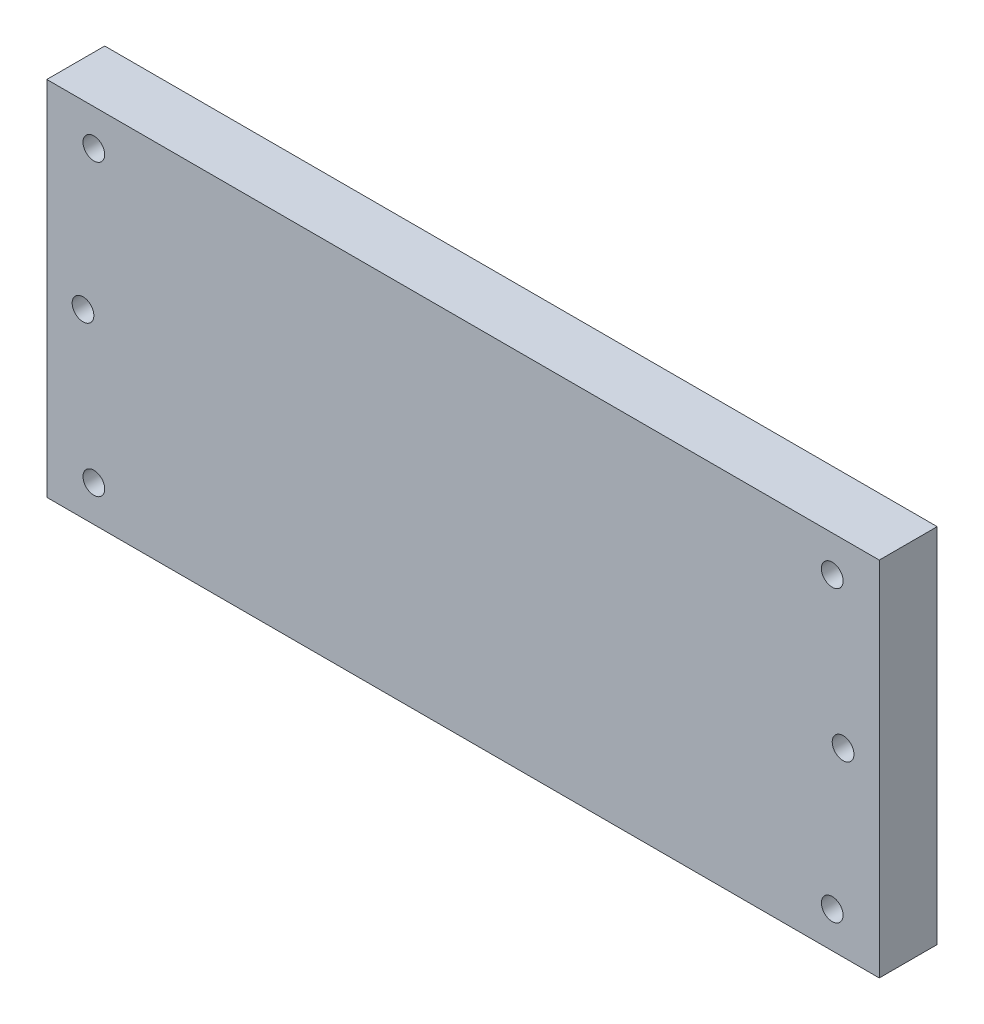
ISO-10303-21;
HEADER;
FILE_DESCRIPTION(('STEP AP214'),'2;1');
FILE_NAME('part.step','',(''),(''),'','','');
FILE_SCHEMA(('AUTOMOTIVE_DESIGN { 1 0 10303 214 1 1 1 1 }'));
ENDSEC;
DATA;
#1=APPLICATION_CONTEXT('core data for automotive mechanical design processes');
#2=APPLICATION_PROTOCOL_DEFINITION('international standard','automotive_design',2000,#1);
#3=PRODUCT_CONTEXT('',#1,'mechanical');
#4=PRODUCT('Part','Part','',(#3));
#5=PRODUCT_RELATED_PRODUCT_CATEGORY('part','',(#4));
#6=PRODUCT_DEFINITION_FORMATION('','',#4);
#7=PRODUCT_DEFINITION_CONTEXT('part definition',#1,'design');
#8=PRODUCT_DEFINITION('design','',#6,#7);
#9=PRODUCT_DEFINITION_SHAPE('','',#8);
#10=(LENGTH_UNIT() NAMED_UNIT(*) SI_UNIT(.MILLI.,.METRE.));
#11=(NAMED_UNIT(*) PLANE_ANGLE_UNIT() SI_UNIT($,.RADIAN.));
#12=(NAMED_UNIT(*) SI_UNIT($,.STERADIAN.) SOLID_ANGLE_UNIT());
#13=UNCERTAINTY_MEASURE_WITH_UNIT(LENGTH_MEASURE(1.E-05),#10,'distance_accuracy_value','');
#14=(GEOMETRIC_REPRESENTATION_CONTEXT(3) GLOBAL_UNCERTAINTY_ASSIGNED_CONTEXT((#13)) GLOBAL_UNIT_ASSIGNED_CONTEXT((#10,
#11,#12)) REPRESENTATION_CONTEXT('',''));
#15=CARTESIAN_POINT('',(0.,0.,0.));
#16=DIRECTION('',(0.,0.,1.));
#17=DIRECTION('',(1.,0.,0.));
#18=AXIS2_PLACEMENT_3D('',#15,#16,#17);
#19=CARTESIAN_POINT('',(-33.7316222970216,28.093300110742,8.));
#20=DIRECTION('',(1.,0.,0.));
#21=DIRECTION('',(0.,1.,0.));
#22=AXIS2_PLACEMENT_3D('',#19,#20,#21);
#23=PLANE('',#22);
#24=DIRECTION('',(0.,-1.,0.));
#25=VECTOR('',#24,1.);
#26=CARTESIAN_POINT('',(-33.7316222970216,28.093300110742,0.));
#27=LINE('',#26,#25);
#28=CARTESIAN_POINT('',(-33.7316222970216,28.093300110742,0.));
#29=VERTEX_POINT('',#28);
#30=CARTESIAN_POINT('',(-33.7316222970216,-21.906699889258,0.));
#31=VERTEX_POINT('',#30);
#32=EDGE_CURVE('E99',#29,#31,#27,.T.);
#33=ORIENTED_EDGE('',*,*,#32,.T.);
#34=DIRECTION('',(0.,0.,-1.));
#35=VECTOR('',#34,1.);
#36=CARTESIAN_POINT('',(-33.7316222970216,-21.906699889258,8.));
#37=LINE('',#36,#35);
#38=CARTESIAN_POINT('',(-33.7316222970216,-21.906699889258,8.));
#39=VERTEX_POINT('',#38);
#40=EDGE_CURVE('E11',#39,#31,#37,.T.);
#41=ORIENTED_EDGE('',*,*,#40,.F.);
#42=DIRECTION('',(0.,-1.,0.));
#43=VECTOR('',#42,1.);
#44=CARTESIAN_POINT('',(-33.7316222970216,28.093300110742,8.));
#45=LINE('',#44,#43);
#46=CARTESIAN_POINT('',(-33.7316222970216,28.093300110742,8.));
#47=VERTEX_POINT('',#46);
#48=EDGE_CURVE('E86',#47,#39,#45,.T.);
#49=ORIENTED_EDGE('',*,*,#48,.F.);
#50=DIRECTION('',(0.,0.,-1.));
#51=VECTOR('',#50,1.);
#52=CARTESIAN_POINT('',(-33.7316222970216,28.093300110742,8.));
#53=LINE('',#52,#51);
#54=EDGE_CURVE('E95',#47,#29,#53,.T.);
#55=ORIENTED_EDGE('',*,*,#54,.T.);
#56=EDGE_LOOP('',(#33,#41,#49,#55));
#57=FACE_BOUND('',#56,.T.);
#58=ADVANCED_FACE('F33',(#57),#23,.F.);
#59=CARTESIAN_POINT('',(-33.7316222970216,-21.906699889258,8.));
#60=DIRECTION('',(0.,1.,0.));
#61=DIRECTION('',(0.,0.,1.));
#62=AXIS2_PLACEMENT_3D('',#59,#60,#61);
#63=PLANE('',#62);
#64=DIRECTION('',(1.,0.,0.));
#65=VECTOR('',#64,1.);
#66=CARTESIAN_POINT('',(-33.7316222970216,-21.906699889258,0.));
#67=LINE('',#66,#65);
#68=CARTESIAN_POINT('',(81.2683777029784,-21.906699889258,0.));
#69=VERTEX_POINT('',#68);
#70=EDGE_CURVE('E90',#31,#69,#67,.T.);
#71=ORIENTED_EDGE('',*,*,#70,.T.);
#72=DIRECTION('',(0.,0.,-1.));
#73=VECTOR('',#72,1.);
#74=CARTESIAN_POINT('',(81.2683777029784,-21.906699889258,8.));
#75=LINE('',#74,#73);
#76=CARTESIAN_POINT('',(81.2683777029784,-21.906699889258,8.));
#77=VERTEX_POINT('',#76);
#78=EDGE_CURVE('E42',#77,#69,#75,.T.);
#79=ORIENTED_EDGE('',*,*,#78,.F.);
#80=DIRECTION('',(1.,0.,0.));
#81=VECTOR('',#80,1.);
#82=CARTESIAN_POINT('',(-33.7316222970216,-21.906699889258,8.));
#83=LINE('',#82,#81);
#84=EDGE_CURVE('E81',#39,#77,#83,.T.);
#85=ORIENTED_EDGE('',*,*,#84,.F.);
#86=ORIENTED_EDGE('',*,*,#40,.T.);
#87=EDGE_LOOP('',(#71,#79,#85,#86));
#88=FACE_BOUND('',#87,.T.);
#89=ADVANCED_FACE('F89',(#88),#63,.F.);
#90=CARTESIAN_POINT('',(81.2683777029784,28.093300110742,8.));
#91=DIRECTION('',(-1.,0.,0.));
#92=DIRECTION('',(0.,-1.,0.));
#93=AXIS2_PLACEMENT_3D('',#90,#91,#92);
#94=PLANE('',#93);
#95=DIRECTION('',(0.,1.,0.));
#96=VECTOR('',#95,1.);
#97=CARTESIAN_POINT('',(81.2683777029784,28.093300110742,0.));
#98=LINE('',#97,#96);
#99=CARTESIAN_POINT('',(81.2683777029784,28.093300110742,0.));
#100=VERTEX_POINT('',#99);
#101=EDGE_CURVE('E68',#69,#100,#98,.T.);
#102=ORIENTED_EDGE('',*,*,#101,.T.);
#103=DIRECTION('',(0.,0.,-1.));
#104=VECTOR('',#103,1.);
#105=CARTESIAN_POINT('',(81.2683777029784,28.093300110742,8.));
#106=LINE('',#105,#104);
#107=CARTESIAN_POINT('',(81.2683777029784,28.093300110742,8.));
#108=VERTEX_POINT('',#107);
#109=EDGE_CURVE('E91',#108,#100,#106,.T.);
#110=ORIENTED_EDGE('',*,*,#109,.F.);
#111=DIRECTION('',(0.,1.,0.));
#112=VECTOR('',#111,1.);
#113=CARTESIAN_POINT('',(81.2683777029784,28.093300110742,8.));
#114=LINE('',#113,#112);
#115=EDGE_CURVE('E84',#77,#108,#114,.T.);
#116=ORIENTED_EDGE('',*,*,#115,.F.);
#117=ORIENTED_EDGE('',*,*,#78,.T.);
#118=EDGE_LOOP('',(#102,#110,#116,#117));
#119=FACE_BOUND('',#118,.T.);
#120=ADVANCED_FACE('F93',(#119),#94,.F.);
#121=CARTESIAN_POINT('',(-33.7316222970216,28.093300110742,8.));
#122=DIRECTION('',(0.,-1.,0.));
#123=DIRECTION('',(0.,0.,-1.));
#124=AXIS2_PLACEMENT_3D('',#121,#122,#123);
#125=PLANE('',#124);
#126=DIRECTION('',(-1.,0.,0.));
#127=VECTOR('',#126,1.);
#128=CARTESIAN_POINT('',(-33.7316222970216,28.093300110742,0.));
#129=LINE('',#128,#127);
#130=EDGE_CURVE('E74',#100,#29,#129,.T.);
#131=ORIENTED_EDGE('',*,*,#130,.T.);
#132=ORIENTED_EDGE('',*,*,#54,.F.);
#133=DIRECTION('',(-1.,0.,0.));
#134=VECTOR('',#133,1.);
#135=CARTESIAN_POINT('',(-33.7316222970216,28.093300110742,8.));
#136=LINE('',#135,#134);
#137=EDGE_CURVE('E51',#108,#47,#136,.T.);
#138=ORIENTED_EDGE('',*,*,#137,.F.);
#139=ORIENTED_EDGE('',*,*,#109,.T.);
#140=EDGE_LOOP('',(#131,#132,#138,#139));
#141=FACE_BOUND('',#140,.T.);
#142=ADVANCED_FACE('F165',(#141),#125,.F.);
#143=CARTESIAN_POINT('',(0.,0.,8.));
#144=DIRECTION('',(0.,0.,1.));
#145=DIRECTION('',(1.,0.,0.));
#146=AXIS2_PLACEMENT_3D('',#143,#144,#145);
#147=PLANE('',#146);
#148=CARTESIAN_POINT('',(76.2683777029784,3.09330010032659,8.));
#149=DIRECTION('',(0.,0.,1.));
#150=DIRECTION('',(1.,0.,0.));
#151=AXIS2_PLACEMENT_3D('',#148,#149,#150);
#152=CIRCLE('',#151,1.5);
#153=CARTESIAN_POINT('',(77.7683777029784,3.09330010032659,8.));
#154=VERTEX_POINT('',#153);
#155=EDGE_CURVE('E136',#154,#154,#152,.T.);
#156=ORIENTED_EDGE('',*,*,#155,.F.);
#157=EDGE_LOOP('',(#156));
#158=FACE_BOUND('',#157,.T.);
#159=CARTESIAN_POINT('',(-28.7316222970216,3.09330010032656,8.));
#160=DIRECTION('',(0.,0.,1.));
#161=DIRECTION('',(1.,0.,0.));
#162=AXIS2_PLACEMENT_3D('',#159,#160,#161);
#163=CIRCLE('',#162,1.5);
#164=CARTESIAN_POINT('',(-27.2316222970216,3.09330010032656,8.));
#165=VERTEX_POINT('',#164);
#166=EDGE_CURVE('E126',#165,#165,#163,.T.);
#167=ORIENTED_EDGE('',*,*,#166,.F.);
#168=EDGE_LOOP('',(#167));
#169=FACE_BOUND('',#168,.T.);
#170=CARTESIAN_POINT('',(74.7683777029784,-16.906699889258,8.));
#171=DIRECTION('',(0.,0.,1.));
#172=DIRECTION('',(1.,0.,0.));
#173=AXIS2_PLACEMENT_3D('',#170,#171,#172);
#174=CIRCLE('',#173,1.5);
#175=CARTESIAN_POINT('',(76.2683777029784,-16.906699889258,8.));
#176=VERTEX_POINT('',#175);
#177=EDGE_CURVE('E123',#176,#176,#174,.T.);
#178=ORIENTED_EDGE('',*,*,#177,.F.);
#179=EDGE_LOOP('',(#178));
#180=FACE_BOUND('',#179,.T.);
#181=CARTESIAN_POINT('',(74.7683777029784,23.093300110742,8.));
#182=DIRECTION('',(0.,0.,1.));
#183=DIRECTION('',(1.,0.,0.));
#184=AXIS2_PLACEMENT_3D('',#181,#182,#183);
#185=CIRCLE('',#184,1.5);
#186=CARTESIAN_POINT('',(76.2683777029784,23.093300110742,8.));
#187=VERTEX_POINT('',#186);
#188=EDGE_CURVE('E120',#187,#187,#185,.T.);
#189=ORIENTED_EDGE('',*,*,#188,.F.);
#190=EDGE_LOOP('',(#189));
#191=FACE_BOUND('',#190,.T.);
#192=CARTESIAN_POINT('',(-27.2316222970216,-16.906699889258,8.));
#193=DIRECTION('',(0.,0.,1.));
#194=DIRECTION('',(1.,0.,0.));
#195=AXIS2_PLACEMENT_3D('',#192,#193,#194);
#196=CIRCLE('',#195,1.5);
#197=CARTESIAN_POINT('',(-25.7316222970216,-16.906699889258,8.));
#198=VERTEX_POINT('',#197);
#199=EDGE_CURVE('E116',#198,#198,#196,.T.);
#200=ORIENTED_EDGE('',*,*,#199,.F.);
#201=EDGE_LOOP('',(#200));
#202=FACE_BOUND('',#201,.T.);
#203=CARTESIAN_POINT('',(-27.2316222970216,23.0933001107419,8.));
#204=DIRECTION('',(0.,0.,1.));
#205=DIRECTION('',(1.,0.,0.));
#206=AXIS2_PLACEMENT_3D('',#203,#204,#205);
#207=CIRCLE('',#206,1.5);
#208=CARTESIAN_POINT('',(-25.7316222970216,23.0933001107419,8.));
#209=VERTEX_POINT('',#208);
#210=EDGE_CURVE('E112',#209,#209,#207,.T.);
#211=ORIENTED_EDGE('',*,*,#210,.F.);
#212=EDGE_LOOP('',(#211));
#213=FACE_BOUND('',#212,.T.);
#214=ORIENTED_EDGE('',*,*,#48,.T.);
#215=ORIENTED_EDGE('',*,*,#84,.T.);
#216=ORIENTED_EDGE('',*,*,#115,.T.);
#217=ORIENTED_EDGE('',*,*,#137,.T.);
#218=EDGE_LOOP('',(#214,#215,#216,#217));
#219=FACE_BOUND('',#218,.T.);
#220=ADVANCED_FACE('F82',(#158,#169,#180,#191,#202,#213,#219),#147,.T.);
#221=CARTESIAN_POINT('',(0.,0.,0.));
#222=DIRECTION('',(0.,0.,1.));
#223=DIRECTION('',(1.,0.,0.));
#224=AXIS2_PLACEMENT_3D('',#221,#222,#223);
#225=PLANE('',#224);
#226=CARTESIAN_POINT('',(74.7683777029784,-16.906699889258,0.));
#227=DIRECTION('',(0.,0.,1.));
#228=DIRECTION('',(1.,0.,0.));
#229=AXIS2_PLACEMENT_3D('',#226,#227,#228);
#230=CIRCLE('',#229,1.5);
#231=CARTESIAN_POINT('',(76.2683777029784,-16.906699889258,0.));
#232=VERTEX_POINT('',#231);
#233=EDGE_CURVE('E121',#232,#232,#230,.T.);
#234=ORIENTED_EDGE('',*,*,#233,.T.);
#235=EDGE_LOOP('',(#234));
#236=FACE_BOUND('',#235,.T.);
#237=CARTESIAN_POINT('',(74.7683777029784,23.093300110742,0.));
#238=DIRECTION('',(0.,0.,1.));
#239=DIRECTION('',(1.,0.,0.));
#240=AXIS2_PLACEMENT_3D('',#237,#238,#239);
#241=CIRCLE('',#240,1.5);
#242=CARTESIAN_POINT('',(76.2683777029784,23.093300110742,0.));
#243=VERTEX_POINT('',#242);
#244=EDGE_CURVE('E117',#243,#243,#241,.T.);
#245=ORIENTED_EDGE('',*,*,#244,.T.);
#246=EDGE_LOOP('',(#245));
#247=FACE_BOUND('',#246,.T.);
#248=CARTESIAN_POINT('',(-27.2316222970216,-16.906699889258,0.));
#249=DIRECTION('',(0.,0.,1.));
#250=DIRECTION('',(1.,0.,0.));
#251=AXIS2_PLACEMENT_3D('',#248,#249,#250);
#252=CIRCLE('',#251,1.5);
#253=CARTESIAN_POINT('',(-25.7316222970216,-16.906699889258,0.));
#254=VERTEX_POINT('',#253);
#255=EDGE_CURVE('E113',#254,#254,#252,.T.);
#256=ORIENTED_EDGE('',*,*,#255,.T.);
#257=EDGE_LOOP('',(#256));
#258=FACE_BOUND('',#257,.T.);
#259=CARTESIAN_POINT('',(-27.2316222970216,23.0933001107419,0.));
#260=DIRECTION('',(0.,0.,1.));
#261=DIRECTION('',(1.,0.,0.));
#262=AXIS2_PLACEMENT_3D('',#259,#260,#261);
#263=CIRCLE('',#262,1.5);
#264=CARTESIAN_POINT('',(-25.7316222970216,23.0933001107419,0.));
#265=VERTEX_POINT('',#264);
#266=EDGE_CURVE('E108',#265,#265,#263,.T.);
#267=ORIENTED_EDGE('',*,*,#266,.T.);
#268=EDGE_LOOP('',(#267));
#269=FACE_BOUND('',#268,.T.);
#270=CARTESIAN_POINT('',(-28.7316222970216,3.09330010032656,0.));
#271=DIRECTION('',(0.,0.,-1.));
#272=DIRECTION('',(-1.,0.,0.));
#273=AXIS2_PLACEMENT_3D('',#270,#271,#272);
#274=CIRCLE('',#273,4.00000000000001);
#275=CARTESIAN_POINT('',(-32.7316222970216,3.09330010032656,0.));
#276=VERTEX_POINT('',#275);
#277=EDGE_CURVE('E111',#276,#276,#274,.T.);
#278=ORIENTED_EDGE('',*,*,#277,.F.);
#279=EDGE_LOOP('',(#278));
#280=FACE_BOUND('',#279,.T.);
#281=CARTESIAN_POINT('',(76.2683777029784,3.09330010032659,0.));
#282=DIRECTION('',(0.,0.,-1.));
#283=DIRECTION('',(-1.,0.,0.));
#284=AXIS2_PLACEMENT_3D('',#281,#282,#283);
#285=CIRCLE('',#284,4.00000000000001);
#286=CARTESIAN_POINT('',(72.2683777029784,3.09330010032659,0.));
#287=VERTEX_POINT('',#286);
#288=EDGE_CURVE('E148',#287,#287,#285,.T.);
#289=ORIENTED_EDGE('',*,*,#288,.F.);
#290=EDGE_LOOP('',(#289));
#291=FACE_BOUND('',#290,.T.);
#292=ORIENTED_EDGE('',*,*,#32,.F.);
#293=ORIENTED_EDGE('',*,*,#130,.F.);
#294=ORIENTED_EDGE('',*,*,#101,.F.);
#295=ORIENTED_EDGE('',*,*,#70,.F.);
#296=EDGE_LOOP('',(#292,#293,#294,#295));
#297=FACE_BOUND('',#296,.T.);
#298=ADVANCED_FACE('F158',(#236,#247,#258,#269,#280,#291,#297),#225,.F.);
#299=CARTESIAN_POINT('',(76.2683777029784,3.09330010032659,4.));
#300=DIRECTION('',(0.,0.,-1.));
#301=DIRECTION('',(-1.,0.,0.));
#302=AXIS2_PLACEMENT_3D('',#299,#300,#301);
#303=CYLINDRICAL_SURFACE('',#302,4.00000000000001);
#304=CARTESIAN_POINT('',(76.2683777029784,3.09330010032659,4.));
#305=DIRECTION('',(0.,0.,-1.));
#306=DIRECTION('',(-1.,0.,0.));
#307=AXIS2_PLACEMENT_3D('',#304,#305,#306);
#308=CIRCLE('',#307,4.00000000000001);
#309=CARTESIAN_POINT('',(72.2683777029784,3.09330010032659,4.));
#310=VERTEX_POINT('',#309);
#311=EDGE_CURVE('E102',#310,#310,#308,.T.);
#312=ORIENTED_EDGE('',*,*,#311,.F.);
#313=EDGE_LOOP('',(#312));
#314=FACE_BOUND('',#313,.T.);
#315=ORIENTED_EDGE('',*,*,#288,.T.);
#316=EDGE_LOOP('',(#315));
#317=FACE_BOUND('',#316,.T.);
#318=ADVANCED_FACE('F156',(#314,#317),#303,.F.);
#319=CARTESIAN_POINT('',(76.2683777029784,3.09330010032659,4.));
#320=DIRECTION('',(0.,0.,-1.));
#321=DIRECTION('',(-1.,0.,0.));
#322=AXIS2_PLACEMENT_3D('',#319,#320,#321);
#323=PLANE('',#322);
#324=CARTESIAN_POINT('',(76.2683777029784,3.09330010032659,4.));
#325=DIRECTION('',(0.,0.,-1.));
#326=DIRECTION('',(-1.,0.,0.));
#327=AXIS2_PLACEMENT_3D('',#324,#325,#326);
#328=CIRCLE('',#327,1.5);
#329=CARTESIAN_POINT('',(74.7683777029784,3.09330010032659,4.));
#330=VERTEX_POINT('',#329);
#331=EDGE_CURVE('E36',#330,#330,#328,.T.);
#332=ORIENTED_EDGE('',*,*,#331,.F.);
#333=EDGE_LOOP('',(#332));
#334=FACE_BOUND('',#333,.T.);
#335=ORIENTED_EDGE('',*,*,#311,.T.);
#336=EDGE_LOOP('',(#335));
#337=FACE_BOUND('',#336,.T.);
#338=ADVANCED_FACE('F199',(#334,#337),#323,.T.);
#339=CARTESIAN_POINT('',(-28.7316222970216,3.09330010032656,4.));
#340=DIRECTION('',(0.,0.,-1.));
#341=DIRECTION('',(-1.,0.,0.));
#342=AXIS2_PLACEMENT_3D('',#339,#340,#341);
#343=CYLINDRICAL_SURFACE('',#342,4.00000000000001);
#344=CARTESIAN_POINT('',(-28.7316222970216,3.09330010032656,4.));
#345=DIRECTION('',(0.,0.,-1.));
#346=DIRECTION('',(-1.,0.,0.));
#347=AXIS2_PLACEMENT_3D('',#344,#345,#346);
#348=CIRCLE('',#347,4.00000000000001);
#349=CARTESIAN_POINT('',(-32.7316222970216,3.09330010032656,4.));
#350=VERTEX_POINT('',#349);
#351=EDGE_CURVE('E145',#350,#350,#348,.T.);
#352=ORIENTED_EDGE('',*,*,#351,.F.);
#353=EDGE_LOOP('',(#352));
#354=FACE_BOUND('',#353,.T.);
#355=ORIENTED_EDGE('',*,*,#277,.T.);
#356=EDGE_LOOP('',(#355));
#357=FACE_BOUND('',#356,.T.);
#358=ADVANCED_FACE('F208',(#354,#357),#343,.F.);
#359=CARTESIAN_POINT('',(-28.7316222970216,3.09330010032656,4.));
#360=DIRECTION('',(0.,0.,-1.));
#361=DIRECTION('',(-1.,0.,0.));
#362=AXIS2_PLACEMENT_3D('',#359,#360,#361);
#363=PLANE('',#362);
#364=CARTESIAN_POINT('',(-28.7316222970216,3.09330010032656,4.));
#365=DIRECTION('',(0.,0.,-1.));
#366=DIRECTION('',(-1.,0.,0.));
#367=AXIS2_PLACEMENT_3D('',#364,#365,#366);
#368=CIRCLE('',#367,1.5);
#369=CARTESIAN_POINT('',(-30.2316222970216,3.09330010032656,4.));
#370=VERTEX_POINT('',#369);
#371=EDGE_CURVE('E124',#370,#370,#368,.T.);
#372=ORIENTED_EDGE('',*,*,#371,.F.);
#373=EDGE_LOOP('',(#372));
#374=FACE_BOUND('',#373,.T.);
#375=ORIENTED_EDGE('',*,*,#351,.T.);
#376=EDGE_LOOP('',(#375));
#377=FACE_BOUND('',#376,.T.);
#378=ADVANCED_FACE('F213',(#374,#377),#363,.T.);
#379=CARTESIAN_POINT('',(-27.2316222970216,23.0933001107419,-2.));
#380=DIRECTION('',(0.,0.,1.));
#381=DIRECTION('',(1.,0.,0.));
#382=AXIS2_PLACEMENT_3D('',#379,#380,#381);
#383=CYLINDRICAL_SURFACE('',#382,1.5);
#384=ORIENTED_EDGE('',*,*,#210,.T.);
#385=EDGE_LOOP('',(#384));
#386=FACE_BOUND('',#385,.T.);
#387=ORIENTED_EDGE('',*,*,#266,.F.);
#388=EDGE_LOOP('',(#387));
#389=FACE_BOUND('',#388,.T.);
#390=ADVANCED_FACE('F240',(#386,#389),#383,.F.);
#391=CARTESIAN_POINT('',(-27.2316222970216,-16.906699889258,-2.));
#392=DIRECTION('',(0.,0.,1.));
#393=DIRECTION('',(1.,0.,0.));
#394=AXIS2_PLACEMENT_3D('',#391,#392,#393);
#395=CYLINDRICAL_SURFACE('',#394,1.5);
#396=ORIENTED_EDGE('',*,*,#199,.T.);
#397=EDGE_LOOP('',(#396));
#398=FACE_BOUND('',#397,.T.);
#399=ORIENTED_EDGE('',*,*,#255,.F.);
#400=EDGE_LOOP('',(#399));
#401=FACE_BOUND('',#400,.T.);
#402=ADVANCED_FACE('F250',(#398,#401),#395,.F.);
#403=CARTESIAN_POINT('',(74.7683777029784,23.093300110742,-2.));
#404=DIRECTION('',(0.,0.,1.));
#405=DIRECTION('',(1.,0.,0.));
#406=AXIS2_PLACEMENT_3D('',#403,#404,#405);
#407=CYLINDRICAL_SURFACE('',#406,1.5);
#408=ORIENTED_EDGE('',*,*,#188,.T.);
#409=EDGE_LOOP('',(#408));
#410=FACE_BOUND('',#409,.T.);
#411=ORIENTED_EDGE('',*,*,#244,.F.);
#412=EDGE_LOOP('',(#411));
#413=FACE_BOUND('',#412,.T.);
#414=ADVANCED_FACE('F260',(#410,#413),#407,.F.);
#415=CARTESIAN_POINT('',(74.7683777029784,-16.906699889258,-2.));
#416=DIRECTION('',(0.,0.,1.));
#417=DIRECTION('',(1.,0.,0.));
#418=AXIS2_PLACEMENT_3D('',#415,#416,#417);
#419=CYLINDRICAL_SURFACE('',#418,1.5);
#420=ORIENTED_EDGE('',*,*,#177,.T.);
#421=EDGE_LOOP('',(#420));
#422=FACE_BOUND('',#421,.T.);
#423=ORIENTED_EDGE('',*,*,#233,.F.);
#424=EDGE_LOOP('',(#423));
#425=FACE_BOUND('',#424,.T.);
#426=ADVANCED_FACE('F270',(#422,#425),#419,.F.);
#427=CARTESIAN_POINT('',(-28.7316222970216,3.09330010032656,-2.));
#428=DIRECTION('',(0.,0.,1.));
#429=DIRECTION('',(1.,0.,0.));
#430=AXIS2_PLACEMENT_3D('',#427,#428,#429);
#431=CYLINDRICAL_SURFACE('',#430,1.5);
#432=ORIENTED_EDGE('',*,*,#371,.T.);
#433=EDGE_LOOP('',(#432));
#434=FACE_BOUND('',#433,.T.);
#435=ORIENTED_EDGE('',*,*,#166,.T.);
#436=EDGE_LOOP('',(#435));
#437=FACE_BOUND('',#436,.T.);
#438=ADVANCED_FACE('F280',(#434,#437),#431,.F.);
#439=CARTESIAN_POINT('',(76.2683777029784,3.09330010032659,-2.));
#440=DIRECTION('',(0.,0.,1.));
#441=DIRECTION('',(1.,0.,0.));
#442=AXIS2_PLACEMENT_3D('',#439,#440,#441);
#443=CYLINDRICAL_SURFACE('',#442,1.5);
#444=ORIENTED_EDGE('',*,*,#331,.T.);
#445=EDGE_LOOP('',(#444));
#446=FACE_BOUND('',#445,.T.);
#447=ORIENTED_EDGE('',*,*,#155,.T.);
#448=EDGE_LOOP('',(#447));
#449=FACE_BOUND('',#448,.T.);
#450=ADVANCED_FACE('F290',(#446,#449),#443,.F.);
#451=CLOSED_SHELL('',(#58,#89,#120,#142,#220,#298,#318,#338,#358,#378,#390,#402,#414,#426,#438,#450));
#452=MANIFOLD_SOLID_BREP('B2',#451);
#453=ADVANCED_BREP_SHAPE_REPRESENTATION('',(#18,#452),#14);
#454=SHAPE_DEFINITION_REPRESENTATION(#9,#453);
ENDSEC;
END-ISO-10303-21;
